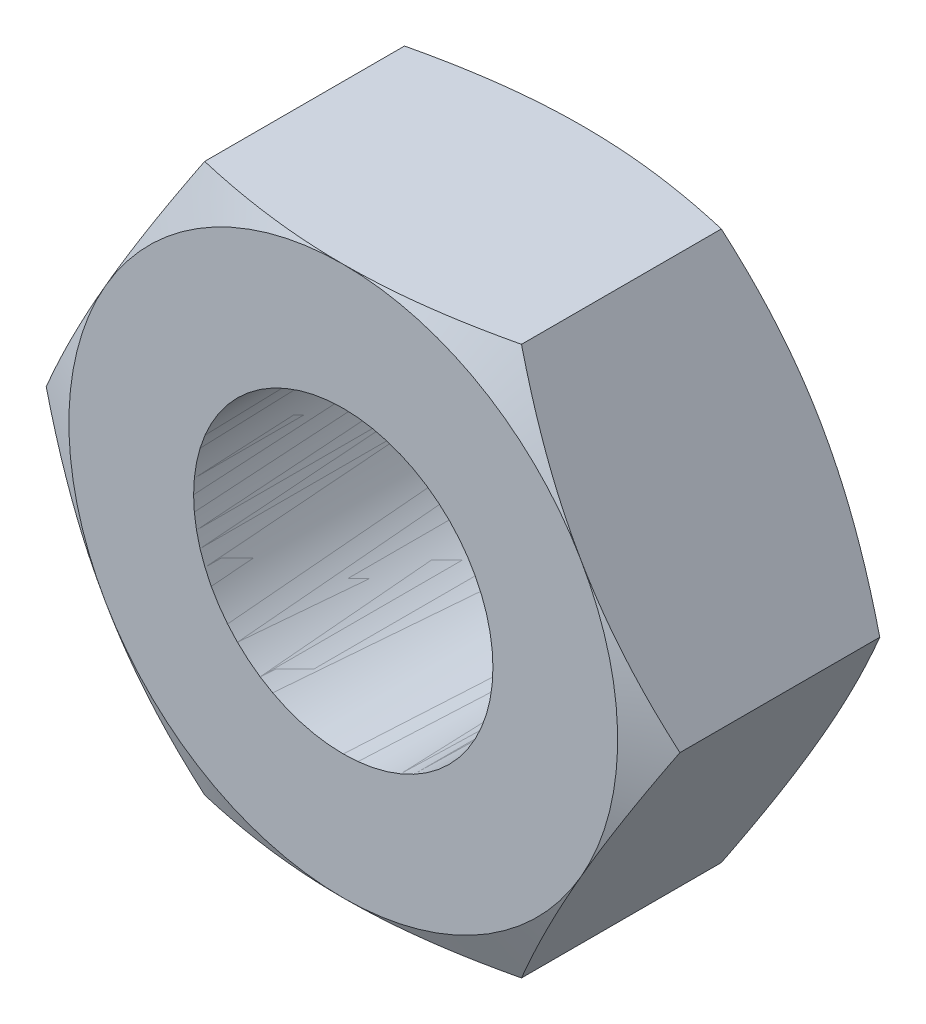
ISO-10303-21;
HEADER;
FILE_DESCRIPTION(('STEP AP214'),'2;1');
FILE_NAME('part.step','',(''),(''),'','','');
FILE_SCHEMA(('AUTOMOTIVE_DESIGN { 1 0 10303 214 1 1 1 1 }'));
ENDSEC;
DATA;
#1=APPLICATION_CONTEXT('core data for automotive mechanical design processes');
#2=APPLICATION_PROTOCOL_DEFINITION('international standard','automotive_design',2000,#1);
#3=PRODUCT_CONTEXT('',#1,'mechanical');
#4=PRODUCT('Part','Part','',(#3));
#5=PRODUCT_RELATED_PRODUCT_CATEGORY('part','',(#4));
#6=PRODUCT_DEFINITION_FORMATION('','',#4);
#7=PRODUCT_DEFINITION_CONTEXT('part definition',#1,'design');
#8=PRODUCT_DEFINITION('design','',#6,#7);
#9=PRODUCT_DEFINITION_SHAPE('','',#8);
#10=(LENGTH_UNIT() NAMED_UNIT(*) SI_UNIT(.MILLI.,.METRE.));
#11=(NAMED_UNIT(*) PLANE_ANGLE_UNIT() SI_UNIT($,.RADIAN.));
#12=(NAMED_UNIT(*) SI_UNIT($,.STERADIAN.) SOLID_ANGLE_UNIT());
#13=UNCERTAINTY_MEASURE_WITH_UNIT(LENGTH_MEASURE(1.E-05),#10,'distance_accuracy_value','');
#14=(GEOMETRIC_REPRESENTATION_CONTEXT(3) GLOBAL_UNCERTAINTY_ASSIGNED_CONTEXT((#13)) GLOBAL_UNIT_ASSIGNED_CONTEXT((#10,
#11,#12)) REPRESENTATION_CONTEXT('',''));
#15=CARTESIAN_POINT('',(0.,0.,0.));
#16=DIRECTION('',(0.,0.,1.));
#17=DIRECTION('',(1.,0.,0.));
#18=AXIS2_PLACEMENT_3D('',#15,#16,#17);
#19=CARTESIAN_POINT('',(1.587713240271,-2.75,0.));
#20=DIRECTION('',(0.866025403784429,-0.500000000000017,0.));
#21=DIRECTION('',(0.500000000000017,0.866025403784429,0.));
#22=AXIS2_PLACEMENT_3D('',#19,#20,#21);
#23=PLANE('',#22);
#24=CARTESIAN_POINT('',(3.17542648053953,1.05943048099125E-11,2.2016203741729));
#25=CARTESIAN_POINT('',(3.11028640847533,-0.112825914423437,2.23200076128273));
#26=CARTESIAN_POINT('',(3.04480636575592,-0.226240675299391,2.25972990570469));
#27=CARTESIAN_POINT('',(2.91346266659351,-0.453734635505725,2.30854135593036));
#28=CARTESIAN_POINT('',(2.84760103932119,-0.567810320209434,2.32964568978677));
#29=CARTESIAN_POINT('',(2.71530386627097,-0.796955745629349,2.36409667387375));
#30=CARTESIAN_POINT('',(2.6488679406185,-0.912026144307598,2.37743771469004));
#31=CARTESIAN_POINT('',(2.54888920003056,-1.08519440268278,2.39090948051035));
#32=CARTESIAN_POINT('',(2.51545111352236,-1.14311086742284,2.39431028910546));
#33=CARTESIAN_POINT('',(2.4485329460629,-1.25901653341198,2.39885876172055));
#34=CARTESIAN_POINT('',(2.41505286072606,-1.31700574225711,2.40000616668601));
#35=CARTESIAN_POINT('',(2.38156986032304,-1.37500000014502,2.40000000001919));
#36=B_SPLINE_CURVE_WITH_KNOTS('',3,(#24,#25,#26,#27,#28,#29,#30,#31,#32,#33,#34,#35),
.UNSPECIFIED.,.F.,.F.,(4,2,2,2,2,4),(0.,0.401386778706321,0.801424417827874,1.20175074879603,
1.40260488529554,1.60348211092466),.UNSPECIFIED.);
#37=CARTESIAN_POINT('',(3.17542648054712,1.71279261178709E-13,2.20162037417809));
#38=VERTEX_POINT('',#37);
#39=CARTESIAN_POINT('',(2.38156986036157,-1.37500000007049,2.40000000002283));
#40=VERTEX_POINT('',#39);
#41=EDGE_CURVE('P0_E357',#38,#40,#36,.T.);
#42=ORIENTED_EDGE('',*,*,#41,.T.);
#43=CARTESIAN_POINT('',(2.38156986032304,-1.37500000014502,2.40000000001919));
#44=CARTESIAN_POINT('',(2.34808685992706,-1.4329942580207,2.40000616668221));
#45=CARTESIAN_POINT('',(2.31460677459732,-1.49098346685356,2.39885876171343));
#46=CARTESIAN_POINT('',(2.2476886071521,-1.60688913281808,2.3943102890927));
#47=CARTESIAN_POINT('',(2.21425052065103,-1.66480559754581,2.39090948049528));
#48=CARTESIAN_POINT('',(2.11427178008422,-1.83797385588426,2.37743771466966));
#49=CARTESIAN_POINT('',(2.04783585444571,-1.95304425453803,2.36409667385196));
#50=CARTESIAN_POINT('',(1.91553868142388,-2.18218967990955,2.32964568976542));
#51=CARTESIAN_POINT('',(1.84967705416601,-2.29626536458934,2.30854135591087));
#52=CARTESIAN_POINT('',(1.71833335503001,-2.52375932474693,2.25972990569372));
#53=CARTESIAN_POINT('',(1.65285331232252,-2.63717408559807,2.23200076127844));
#54=CARTESIAN_POINT('',(1.58771324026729,-2.75000000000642,2.20162037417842));
#55=B_SPLINE_CURVE_WITH_KNOTS('',3,(#43,#44,#45,#46,#47,#48,#49,#50,#51,#52,#53,#54),
.UNSPECIFIED.,.F.,.F.,(4,2,2,2,2,4),(0.,0.200877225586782,0.401731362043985,0.802057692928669,
1.20209533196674,1.60348211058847),.UNSPECIFIED.);
#56=CARTESIAN_POINT('',(1.58771324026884,-2.75000000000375,2.20162037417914));
#57=VERTEX_POINT('',#56);
#58=EDGE_CURVE('P0_E157',#40,#57,#55,.T.);
#59=ORIENTED_EDGE('',*,*,#58,.T.);
#60=DIRECTION('',(0.,0.,-1.));
#61=VECTOR('',#60,1.);
#62=CARTESIAN_POINT('',(1.587713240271,-2.75,0.));
#63=LINE('',#62,#61);
#64=CARTESIAN_POINT('',(1.58771324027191,-2.75000000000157,0.19837962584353));
#65=VERTEX_POINT('',#64);
#66=EDGE_CURVE('P0_E138',#65,#57,#63,.F.);
#67=ORIENTED_EDGE('',*,*,#66,.F.);
#68=CARTESIAN_POINT('',(1.58771324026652,-2.750000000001,0.198379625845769));
#69=CARTESIAN_POINT('',(1.65285331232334,-2.63717408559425,0.167999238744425));
#70=CARTESIAN_POINT('',(1.71833335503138,-2.52375932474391,0.14027009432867));
#71=CARTESIAN_POINT('',(1.8496770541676,-2.29626536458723,0.0914586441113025));
#72=CARTESIAN_POINT('',(1.91553868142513,-2.18218967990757,0.0703543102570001));
#73=CARTESIAN_POINT('',(2.04783585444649,-1.95304425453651,0.0359033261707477));
#74=CARTESIAN_POINT('',(2.11427178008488,-1.83797385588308,0.0225622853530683));
#75=CARTESIAN_POINT('',(2.21425052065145,-1.6648055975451,0.00909051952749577));
#76=CARTESIAN_POINT('',(2.24768860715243,-1.60688913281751,0.0056897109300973));
#77=CARTESIAN_POINT('',(2.31460677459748,-1.49098346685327,0.00114123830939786));
#78=CARTESIAN_POINT('',(2.34808685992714,-1.43299425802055,-6.16665937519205E-06));
#79=CARTESIAN_POINT('',(2.38156986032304,-1.37500000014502,3.6409372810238E-12));
#80=B_SPLINE_CURVE_WITH_KNOTS('',3,(#68,#69,#70,#71,#72,#73,#74,#75,#76,#77,#78,#79),
.UNSPECIFIED.,.F.,.F.,(4,2,2,2,2,4),(0.,0.401386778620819,0.80142441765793,1.20175074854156,
1.40260488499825,1.60348211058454),.UNSPECIFIED.);
#81=CARTESIAN_POINT('',(2.38156986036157,-1.37500000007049,0.));
#82=VERTEX_POINT('',#81);
#83=EDGE_CURVE('P0_E21',#65,#82,#80,.T.);
#84=ORIENTED_EDGE('',*,*,#83,.T.);
#85=CARTESIAN_POINT('',(2.38156986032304,-1.37500000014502,3.64106855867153E-12));
#86=CARTESIAN_POINT('',(2.41505286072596,-1.31700574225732,-6.16666319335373E-06));
#87=CARTESIAN_POINT('',(2.44853294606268,-1.25901653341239,0.00114123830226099));
#88=CARTESIAN_POINT('',(2.51545111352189,-1.14311086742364,0.00568971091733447));
#89=CARTESIAN_POINT('',(2.54888920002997,-1.08519440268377,0.00909051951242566));
#90=CARTESIAN_POINT('',(2.64886794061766,-0.912026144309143,0.0225622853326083));
#91=CARTESIAN_POINT('',(2.71530386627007,-0.796955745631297,0.0359033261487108));
#92=CARTESIAN_POINT('',(2.8476010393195,-0.567810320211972,0.0703543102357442));
#93=CARTESIAN_POINT('',(2.91346266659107,-0.45373463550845,0.0914586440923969));
#94=CARTESIAN_POINT('',(3.04480636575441,-0.226240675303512,0.14027009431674));
#95=CARTESIAN_POINT('',(3.11028640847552,-0.112825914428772,0.167999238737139));
#96=CARTESIAN_POINT('',(3.17542648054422,2.9136169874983E-12,0.198379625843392));
#97=B_SPLINE_CURVE_WITH_KNOTS('',3,(#85,#86,#87,#88,#89,#90,#91,#92,#93,#94,#95,#96),
.UNSPECIFIED.,.F.,.F.,(4,2,2,2,2,4),(0.,0.200877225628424,0.40173136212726,0.802057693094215,
1.20209533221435,1.60348211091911),.UNSPECIFIED.);
#98=CARTESIAN_POINT('',(3.17542648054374,1.67338904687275E-12,0.198379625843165));
#99=VERTEX_POINT('',#98);
#100=EDGE_CURVE('P0_E155',#82,#99,#97,.T.);
#101=ORIENTED_EDGE('',*,*,#100,.T.);
#102=DIRECTION('',(0.,0.,1.));
#103=VECTOR('',#102,1.);
#104=CARTESIAN_POINT('',(3.175426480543,0.,0.));
#105=LINE('',#104,#103);
#106=EDGE_CURVE('P0_E171',#38,#99,#105,.F.);
#107=ORIENTED_EDGE('',*,*,#106,.F.);
#108=EDGE_LOOP('',(#42,#59,#67,#84,#101,#107));
#109=FACE_BOUND('',#108,.T.);
#110=ADVANCED_FACE('P0_F17',(#109),#23,.T.);
#111=CARTESIAN_POINT('',(3.175426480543,0.,0.));
#112=DIRECTION('',(0.866025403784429,0.500000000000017,0.));
#113=DIRECTION('',(-0.500000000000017,0.866025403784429,0.));
#114=AXIS2_PLACEMENT_3D('',#111,#112,#113);
#115=PLANE('',#114);
#116=CARTESIAN_POINT('',(1.58771324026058,2.75000000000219,2.2016203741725));
#117=CARTESIAN_POINT('',(1.65285331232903,2.63717408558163,2.23200076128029));
#118=CARTESIAN_POINT('',(1.71833335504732,2.52375932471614,2.25972990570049));
#119=CARTESIAN_POINT('',(1.84967705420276,2.29626536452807,2.3085413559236));
#120=CARTESIAN_POINT('',(1.91553868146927,2.18218967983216,2.32964568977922));
#121=CARTESIAN_POINT('',(2.04783585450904,1.9530442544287,2.36409667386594));
#122=CARTESIAN_POINT('',(2.11427178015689,1.83797385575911,2.37743771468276));
#123=CARTESIAN_POINT('',(2.21425052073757,1.66480559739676,2.39090948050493));
#124=CARTESIAN_POINT('',(2.24768860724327,1.60688913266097,2.39431028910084));
#125=CARTESIAN_POINT('',(2.31460677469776,1.49098346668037,2.39885876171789));
#126=CARTESIAN_POINT('',(2.34808686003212,1.43299425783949,2.4000061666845));
#127=CARTESIAN_POINT('',(2.38156986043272,1.37499999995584,2.400000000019));
#128=B_SPLINE_CURVE_WITH_KNOTS('',3,(#116,#117,#118,#119,#120,#121,#122,#123,#124,#125,#126,
#127),.UNSPECIFIED.,.F.,.F.,(4,2,2,2,2,4),(0.,0.401386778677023,0.801424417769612,
1.20175074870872,1.40260488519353,1.60348211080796),.UNSPECIFIED.);
#129=CARTESIAN_POINT('',(1.58771324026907,2.75000000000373,2.20162037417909));
#130=VERTEX_POINT('',#129);
#131=CARTESIAN_POINT('',(2.38156986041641,1.3749999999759,2.40000000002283));
#132=VERTEX_POINT('',#131);
#133=EDGE_CURVE('P0_E321',#130,#132,#128,.T.);
#134=ORIENTED_EDGE('',*,*,#133,.T.);
#135=CARTESIAN_POINT('',(2.38156986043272,1.37499999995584,2.400000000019));
#136=CARTESIAN_POINT('',(2.41505286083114,1.31700574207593,2.40000616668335));
#137=CARTESIAN_POINT('',(2.44853294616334,1.25901653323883,2.39885876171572));
#138=CARTESIAN_POINT('',(2.51545111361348,1.14311086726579,2.39431028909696));
#139=CARTESIAN_POINT('',(2.54888920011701,1.08519440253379,2.39090948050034));
#140=CARTESIAN_POINT('',(2.64886794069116,0.91202614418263,2.37743771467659));
#141=CARTESIAN_POINT('',(2.71530386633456,0.796955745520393,2.36409667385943));
#142=CARTESIAN_POINT('',(2.84760103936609,0.56781032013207,2.32964568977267));
#143=CARTESIAN_POINT('',(2.91346266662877,0.453734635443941,2.30854135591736));
#144=CARTESIAN_POINT('',(3.04480636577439,0.226240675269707,2.25972990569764));
#145=CARTESIAN_POINT('',(3.11028640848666,0.112825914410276,2.23200076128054));
#146=CARTESIAN_POINT('',(3.17542648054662,-6.27665703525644E-12,2.20162037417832));
#147=B_SPLINE_CURVE_WITH_KNOTS('',3,(#135,#136,#137,#138,#139,#140,#141,#142,#143,#144,#145,
#146),.UNSPECIFIED.,.F.,.F.,(4,2,2,2,2,4),(0.,0.200877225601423,0.401731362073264,
0.802057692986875,1.2020953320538,1.60348211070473),.UNSPECIFIED.);
#148=EDGE_CURVE('P0_E336',#132,#38,#147,.T.);
#149=ORIENTED_EDGE('',*,*,#148,.T.);
#150=ORIENTED_EDGE('',*,*,#106,.T.);
#151=CARTESIAN_POINT('',(3.17542648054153,-4.24707716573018E-12,0.198379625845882));
#152=CARTESIAN_POINT('',(3.11028640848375,0.112825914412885,0.167999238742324));
#153=CARTESIAN_POINT('',(3.04480636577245,0.226240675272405,0.140270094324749));
#154=CARTESIAN_POINT('',(2.91346266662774,0.453734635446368,0.0914586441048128));
#155=CARTESIAN_POINT('',(2.84760103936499,0.56781032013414,0.0703543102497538));
#156=CARTESIAN_POINT('',(2.71530386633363,0.796955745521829,0.0359033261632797));
#157=CARTESIAN_POINT('',(2.64886794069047,0.91202614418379,0.022562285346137));
#158=CARTESIAN_POINT('',(2.5488892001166,1.08519440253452,0.00909051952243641));
#159=CARTESIAN_POINT('',(2.51545111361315,1.14311086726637,0.00568971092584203));
#160=CARTESIAN_POINT('',(2.44853294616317,1.25901653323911,0.00114123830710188));
#161=CARTESIAN_POINT('',(2.41505286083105,1.31700574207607,-6.16666051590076E-06));
#162=CARTESIAN_POINT('',(2.38156986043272,1.37499999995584,3.8260579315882E-12));
#163=B_SPLINE_CURVE_WITH_KNOTS('',3,(#151,#152,#153,#154,#155,#156,#157,#158,#159,#160,#161,
#162),.UNSPECIFIED.,.F.,.F.,(4,2,2,2,2,4),(0.,0.401386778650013,0.801424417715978,
1.20175074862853,1.40260488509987,1.6034821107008),.UNSPECIFIED.);
#164=CARTESIAN_POINT('',(2.38156986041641,1.3749999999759,0.));
#165=VERTEX_POINT('',#164);
#166=EDGE_CURVE('P0_E174',#99,#165,#163,.T.);
#167=ORIENTED_EDGE('',*,*,#166,.T.);
#168=CARTESIAN_POINT('',(2.38156986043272,1.37499999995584,3.82606591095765E-12));
#169=CARTESIAN_POINT('',(2.34808686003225,1.43299425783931,-6.16666168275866E-06));
#170=CARTESIAN_POINT('',(2.31460677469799,1.49098346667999,0.00114123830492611));
#171=CARTESIAN_POINT('',(2.24768860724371,1.6068891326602,0.00568971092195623));
#172=CARTESIAN_POINT('',(2.2142505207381,1.66480559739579,0.00909051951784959));
#173=CARTESIAN_POINT('',(2.11427178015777,1.83797385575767,0.0225622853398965));
#174=CARTESIAN_POINT('',(2.04783585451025,1.95304425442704,0.0359033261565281));
#175=CARTESIAN_POINT('',(1.91553868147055,2.18218967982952,0.0703543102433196));
#176=CARTESIAN_POINT('',(1.8496770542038,2.29626536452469,0.0914586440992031));
#177=CARTESIAN_POINT('',(1.71833335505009,2.52375932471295,0.140270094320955));
#178=CARTESIAN_POINT('',(1.65285331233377,2.63717408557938,0.167999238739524));
#179=CARTESIAN_POINT('',(1.58771324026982,2.75000000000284,0.198379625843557));
#180=B_SPLINE_CURVE_WITH_KNOTS('',3,(#168,#169,#170,#171,#172,#173,#174,#175,#176,#177,#178,
#179),.UNSPECIFIED.,.F.,.F.,(4,2,2,2,2,4),(0.,0.200877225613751,0.401731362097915,
0.802057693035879,1.20209533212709,1.6034821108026),.UNSPECIFIED.);
#181=CARTESIAN_POINT('',(1.58771324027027,2.75000000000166,0.198379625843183));
#182=VERTEX_POINT('',#181);
#183=EDGE_CURVE('P0_E315',#165,#182,#180,.T.);
#184=ORIENTED_EDGE('',*,*,#183,.T.);
#185=DIRECTION('',(0.,0.,1.));
#186=VECTOR('',#185,1.);
#187=CARTESIAN_POINT('',(1.587713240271,2.75,0.));
#188=LINE('',#187,#186);
#189=EDGE_CURVE('P0_E169',#130,#182,#188,.F.);
#190=ORIENTED_EDGE('',*,*,#189,.F.);
#191=EDGE_LOOP('',(#134,#149,#150,#167,#184,#190));
#192=FACE_BOUND('',#191,.T.);
#193=ADVANCED_FACE('P0_F330',(#192),#115,.T.);
#194=CARTESIAN_POINT('',(-1.587713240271,-2.75,0.));
#195=DIRECTION('',(0.,-1.,0.));
#196=DIRECTION('',(0.,0.,-1.));
#197=AXIS2_PLACEMENT_3D('',#194,#195,#196);
#198=PLANE('',#197);
#199=CARTESIAN_POINT('',(1.58771324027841,-2.74999999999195,2.20162037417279));
#200=CARTESIAN_POINT('',(1.45743309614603,-2.74999999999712,2.23200076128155));
#201=CARTESIAN_POINT('',(1.32647301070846,-2.74999999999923,2.2597299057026));
#202=CARTESIAN_POINT('',(1.06378561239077,-2.75000000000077,2.30854135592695));
#203=CARTESIAN_POINT('',(0.932062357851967,-2.7500000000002,2.32964568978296));
#204=CARTESIAN_POINT('',(0.667468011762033,-2.7499999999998,2.36409667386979));
#205=CARTESIAN_POINT('',(0.534596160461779,-2.74999999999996,2.37743771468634));
#206=CARTESIAN_POINT('',(0.334638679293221,-2.75000000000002,2.39090948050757));
#207=CARTESIAN_POINT('',(0.267762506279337,-2.75000000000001,2.39431028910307));
#208=CARTESIAN_POINT('',(0.133926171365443,-2.74999999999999,2.39885876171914));
#209=CARTESIAN_POINT('',(0.066966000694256,-2.74999999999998,2.40000616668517));
#210=CARTESIAN_POINT('',(-1.09340457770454E-10,-2.75,2.40000000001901));
#211=B_SPLINE_CURVE_WITH_KNOTS('',3,(#199,#200,#201,#202,#203,#204,#205,#206,#207,#208,#209,
#210),.UNSPECIFIED.,.F.,.F.,(4,2,2,2,2,4),(0.,0.401386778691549,0.801424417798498,
1.20175074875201,1.40260488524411,1.60348211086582),.UNSPECIFIED.);
#212=CARTESIAN_POINT('',(-5.46700157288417E-11,-2.74999999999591,2.40000000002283));
#213=VERTEX_POINT('',#212);
#214=EDGE_CURVE('P0_E159',#57,#213,#211,.T.);
#215=ORIENTED_EDGE('',*,*,#214,.T.);
#216=CARTESIAN_POINT('',(-1.0934057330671E-10,-2.75,2.40000000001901));
#217=CARTESIAN_POINT('',(-0.0669660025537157,-2.75,2.4000061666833));
#218=CARTESIAN_POINT('',(-0.133926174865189,-2.75,2.39885876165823));
#219=CARTESIAN_POINT('',(-0.267762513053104,-2.75,2.39431028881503));
#220=CARTESIAN_POINT('',(-0.334638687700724,-2.75,2.39090948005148));
#221=CARTESIAN_POINT('',(-0.534596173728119,-2.75,2.37743771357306));
#222=CARTESIAN_POINT('',(-0.667468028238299,-2.75,2.3640966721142));
#223=CARTESIAN_POINT('',(-0.93206238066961,-2.75,2.32964568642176));
#224=CARTESIAN_POINT('',(-1.06378563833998,-2.75,2.30854135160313));
#225=CARTESIAN_POINT('',(-1.3264730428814,-2.75,2.2597298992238));
#226=CARTESIAN_POINT('',(-1.45743313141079,-2.75,2.23200075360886));
#227=CARTESIAN_POINT('',(-1.58771327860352,-2.75,2.20162036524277));
#228=B_SPLINE_CURVE_WITH_KNOTS('',3,(#216,#217,#218,#219,#220,#221,#222,#223,#224,#225,#226,
#227),.UNSPECIFIED.,.F.,.F.,(4,2,2,2,2,4),(0.,0.200877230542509,0.401731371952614,
0.802057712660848,1.20209536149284,1.6034821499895),.UNSPECIFIED.);
#229=CARTESIAN_POINT('',(-1.58771325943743,-2.7500000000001,2.20162036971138));
#230=VERTEX_POINT('',#229);
#231=EDGE_CURVE('P0_E165',#213,#230,#228,.T.);
#232=ORIENTED_EDGE('',*,*,#231,.T.);
#233=DIRECTION('',(0.,0.,1.));
#234=VECTOR('',#233,1.);
#235=CARTESIAN_POINT('',(-1.58771324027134,-2.7500000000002,0.));
#236=LINE('',#235,#234);
#237=CARTESIAN_POINT('',(-1.58771324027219,-2.75000000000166,0.198379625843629));
#238=VERTEX_POINT('',#237);
#239=EDGE_CURVE('P0_E393',#238,#230,#236,.T.);
#240=ORIENTED_EDGE('',*,*,#239,.F.);
#241=CARTESIAN_POINT('',(-1.58771324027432,-2.74999999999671,0.19837962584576));
#242=CARTESIAN_POINT('',(-1.45743309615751,-2.74999999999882,0.167999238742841));
#243=CARTESIAN_POINT('',(-1.32647301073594,-2.74999999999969,0.140270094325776));
#244=CARTESIAN_POINT('',(-1.06378561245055,-2.75000000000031,0.09145864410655));
#245=CARTESIAN_POINT('',(-0.932062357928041,-2.75000000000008,0.0703543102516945));
#246=CARTESIAN_POINT('',(-0.667468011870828,-2.74999999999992,0.0359033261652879));
#247=CARTESIAN_POINT('',(-0.534596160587,-2.74999999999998,0.022562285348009));
#248=CARTESIAN_POINT('',(-0.334638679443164,-2.75000000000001,0.00909051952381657));
#249=CARTESIAN_POINT('',(-0.267762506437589,-2.75,0.00568971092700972));
#250=CARTESIAN_POINT('',(-0.133926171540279,-2.75,0.00114123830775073));
#251=CARTESIAN_POINT('',(-0.0669660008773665,-2.74999999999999,-6.16666017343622E-06));
#252=CARTESIAN_POINT('',(-8.20055384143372E-11,-2.75,3.81689993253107E-12));
#253=B_SPLINE_CURVE_WITH_KNOTS('',3,(#241,#242,#243,#244,#245,#246,#247,#248,#249,#250,#251,
#252),.UNSPECIFIED.,.F.,.F.,(4,2,2,2,2,4),(0.,0.401386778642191,0.801424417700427,
1.20175074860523,1.40260488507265,1.60348211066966),.UNSPECIFIED.);
#254=CARTESIAN_POINT('',(-5.46706050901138E-11,-2.74999999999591,0.));
#255=VERTEX_POINT('',#254);
#256=EDGE_CURVE('P0_E142',#238,#255,#253,.T.);
#257=ORIENTED_EDGE('',*,*,#256,.T.);
#258=CARTESIAN_POINT('',(-8.20059443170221E-11,-2.75,3.81691345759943E-12));
#259=CARTESIAN_POINT('',(0.0669660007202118,-2.75,-6.16666204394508E-06));
#260=CARTESIAN_POINT('',(0.133926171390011,-2.75,0.00114123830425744));
#261=CARTESIAN_POINT('',(0.267762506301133,-2.75,0.00568971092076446));
#262=CARTESIAN_POINT('',(0.334638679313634,-2.75,0.00909051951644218));
#263=CARTESIAN_POINT('',(0.534596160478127,-2.75,0.0225622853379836));
#264=CARTESIAN_POINT('',(0.667468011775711,-2.75,0.0359033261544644));
#265=CARTESIAN_POINT('',(0.93206235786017,-2.75,0.0703543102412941));
#266=CARTESIAN_POINT('',(1.06378561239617,-2.75,0.0914586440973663));
#267=CARTESIAN_POINT('',(1.32647301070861,-2.75,0.140270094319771));
#268=CARTESIAN_POINT('',(1.45743309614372,-2.75,0.167999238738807));
#269=CARTESIAN_POINT('',(1.58771324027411,-2.75,0.198379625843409));
#270=B_SPLINE_CURVE_WITH_KNOTS('',3,(#258,#259,#260,#261,#262,#263,#264,#265,#266,#267,#268,
#269),.UNSPECIFIED.,.F.,.F.,(4,2,2,2,2,4),(0.,0.20087722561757,0.401731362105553,
0.802057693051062,1.2020953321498,1.60348211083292),.UNSPECIFIED.);
#271=EDGE_CURVE('P0_E134',#255,#65,#270,.T.);
#272=ORIENTED_EDGE('',*,*,#271,.T.);
#273=ORIENTED_EDGE('',*,*,#66,.T.);
#274=EDGE_LOOP('',(#215,#232,#240,#257,#272,#273));
#275=FACE_BOUND('',#274,.T.);
#276=ADVANCED_FACE('P0_F136',(#275),#198,.T.);
#277=CARTESIAN_POINT('',(1.587713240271,2.75,0.));
#278=DIRECTION('',(0.,1.,0.));
#279=DIRECTION('',(0.,0.,1.));
#280=AXIS2_PLACEMENT_3D('',#277,#278,#279);
#281=PLANE('',#280);
#282=CARTESIAN_POINT('',(1.09340436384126E-10,2.75,2.40000000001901));
#283=CARTESIAN_POINT('',(-0.0669659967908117,2.75,2.40000616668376));
#284=CARTESIAN_POINT('',(-0.133926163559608,2.75,2.39885876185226));
#285=CARTESIAN_POINT('',(-0.267762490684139,2.75,2.39431028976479));
#286=CARTESIAN_POINT('',(-0.334638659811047,2.75,2.39090948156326));
#287=CARTESIAN_POINT('',(-0.534596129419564,2.75,2.37743771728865));
#288=CARTESIAN_POINT('',(-0.667467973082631,2.75,2.36409667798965));
#289=CARTESIAN_POINT('',(-0.932062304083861,2.75,2.32964569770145));
#290=CARTESIAN_POINT('',(-1.06378555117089,2.75,2.30854136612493));
#291=CARTESIAN_POINT('',(-1.32647293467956,2.75,2.25972992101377));
#292=CARTESIAN_POINT('',(-1.45743301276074,2.75,2.23200077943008));
#293=CARTESIAN_POINT('',(-1.5877131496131,2.75,2.20162039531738));
#294=B_SPLINE_CURVE_WITH_KNOTS('',3,(#282,#283,#284,#285,#286,#287,#288,#289,#290,#291,#292,
#293),.UNSPECIFIED.,.F.,.F.,(4,2,2,2,2,4),(0.,0.200877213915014,0.401731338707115,
0.802057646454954,1.20209526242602,1.60348201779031),.UNSPECIFIED.);
#295=CARTESIAN_POINT('',(5.46698788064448E-11,2.74999999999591,2.40000000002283));
#296=VERTEX_POINT('',#295);
#297=CARTESIAN_POINT('',(-1.58771318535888,2.75000001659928,2.20162038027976));
#298=VERTEX_POINT('',#297);
#299=EDGE_CURVE('P0_E255',#296,#298,#294,.T.);
#300=ORIENTED_EDGE('',*,*,#299,.F.);
#301=CARTESIAN_POINT('',(1.58771324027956,2.75,2.20162037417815));
#302=CARTESIAN_POINT('',(1.45743309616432,2.75,2.23200076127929));
#303=CARTESIAN_POINT('',(1.32647301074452,2.75,2.2597299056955));
#304=CARTESIAN_POINT('',(1.0637856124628,2.75,2.30854135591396));
#305=CARTESIAN_POINT('',(0.932062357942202,2.75,2.32964568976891));
#306=CARTESIAN_POINT('',(0.667468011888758,2.75,2.36409667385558));
#307=CARTESIAN_POINT('',(0.534596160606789,2.75,2.37743771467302));
#308=CARTESIAN_POINT('',(0.334638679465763,2.75,2.39090948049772));
#309=CARTESIAN_POINT('',(0.267762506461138,2.75,2.39431028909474));
#310=CARTESIAN_POINT('',(0.133926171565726,2.75,2.39885876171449));
#311=CARTESIAN_POINT('',(0.0669660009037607,2.75,2.4000061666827));
#312=CARTESIAN_POINT('',(1.09340433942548E-10,2.75,2.40000000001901));
#313=B_SPLINE_CURVE_WITH_KNOTS('',3,(#301,#302,#303,#304,#305,#306,#307,#308,#309,#310,#311,
#312),.UNSPECIFIED.,.F.,.F.,(4,2,2,2,2,4),(0.,0.401386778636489,0.801424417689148,
1.20175074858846,1.40260488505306,1.60348211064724),.UNSPECIFIED.);
#314=EDGE_CURVE('P0_E263',#130,#296,#313,.T.);
#315=ORIENTED_EDGE('',*,*,#314,.F.);
#316=ORIENTED_EDGE('',*,*,#189,.T.);
#317=CARTESIAN_POINT('',(1.58771324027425,2.74999999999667,0.198379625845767));
#318=CARTESIAN_POINT('',(1.45743309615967,2.74999999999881,0.167999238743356));
#319=CARTESIAN_POINT('',(1.32647301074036,2.74999999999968,0.140270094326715));
#320=CARTESIAN_POINT('',(1.0637856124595,2.75000000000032,0.0914586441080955));
#321=CARTESIAN_POINT('',(0.932062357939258,2.75000000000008,0.0703543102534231));
#322=CARTESIAN_POINT('',(0.667468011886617,2.74999999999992,0.0359033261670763));
#323=CARTESIAN_POINT('',(0.534596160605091,2.74999999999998,0.0225622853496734));
#324=CARTESIAN_POINT('',(0.334638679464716,2.75000000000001,0.00909051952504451));
#325=CARTESIAN_POINT('',(0.267762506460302,2.75,0.00568971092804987));
#326=CARTESIAN_POINT('',(0.133926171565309,2.75,0.00114123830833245));
#327=CARTESIAN_POINT('',(0.0669660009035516,2.74999999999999,-6.16665986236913E-06));
#328=CARTESIAN_POINT('',(1.09341077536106E-10,2.75,3.81688347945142E-12));
#329=B_SPLINE_CURVE_WITH_KNOTS('',3,(#317,#318,#319,#320,#321,#322,#323,#324,#325,#326,#327,
#328),.UNSPECIFIED.,.F.,.F.,(4,2,2,2,2,4),(0.,0.401386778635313,0.80142441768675,
1.20175074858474,1.40260488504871,1.60348211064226),.UNSPECIFIED.);
#330=CARTESIAN_POINT('',(5.46704367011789E-11,2.74999999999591,0.));
#331=VERTEX_POINT('',#330);
#332=EDGE_CURVE('P0_E293',#182,#331,#329,.T.);
#333=ORIENTED_EDGE('',*,*,#332,.T.);
#334=CARTESIAN_POINT('',(1.09340994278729E-10,2.75,3.81691899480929E-12));
#335=CARTESIAN_POINT('',(-0.0669660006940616,2.75,-6.16666235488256E-06));
#336=CARTESIAN_POINT('',(-0.13392617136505,2.75,0.00114123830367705));
#337=CARTESIAN_POINT('',(-0.267762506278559,2.75,0.00568971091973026));
#338=CARTESIAN_POINT('',(-0.334638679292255,2.75,0.00909051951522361));
#339=CARTESIAN_POINT('',(-0.53459616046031,2.75,0.0225622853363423));
#340=CARTESIAN_POINT('',(-0.667468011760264,2.75,0.035903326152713));
#341=CARTESIAN_POINT('',(-0.932062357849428,2.75,0.0703543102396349));
#342=CARTESIAN_POINT('',(-1.06378561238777,2.75,0.0914586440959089));
#343=CARTESIAN_POINT('',(-1.32647301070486,2.75,0.14027009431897));
#344=CARTESIAN_POINT('',(-1.4574330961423,2.75,0.167999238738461));
#345=CARTESIAN_POINT('',(-1.58771324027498,2.75,0.198379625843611));
#346=B_SPLINE_CURVE_WITH_KNOTS('',3,(#334,#335,#336,#337,#338,#339,#340,#341,#342,#343,#344,
#345),.UNSPECIFIED.,.F.,.F.,(4,2,2,2,2,4),(0.,0.200877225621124,0.401731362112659,
0.80205769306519,1.20209533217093,1.60348211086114),.UNSPECIFIED.);
#347=CARTESIAN_POINT('',(-1.5877132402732,2.75,0.198379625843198));
#348=VERTEX_POINT('',#347);
#349=EDGE_CURVE('P0_E286',#331,#348,#346,.T.);
#350=ORIENTED_EDGE('',*,*,#349,.T.);
#351=DIRECTION('',(0.,0.,1.));
#352=VECTOR('',#351,1.);
#353=CARTESIAN_POINT('',(-1.587713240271,2.75,0.));
#354=LINE('',#353,#352);
#355=EDGE_CURVE('P0_E458',#298,#348,#354,.F.);
#356=ORIENTED_EDGE('',*,*,#355,.F.);
#357=EDGE_LOOP('',(#300,#315,#316,#333,#350,#356));
#358=FACE_BOUND('',#357,.T.);
#359=ADVANCED_FACE('P0_F272',(#358),#281,.T.);
#360=CARTESIAN_POINT('',(-3.175426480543,0.,0.));
#361=DIRECTION('',(-0.866025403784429,-0.500000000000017,0.));
#362=DIRECTION('',(0.500000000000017,-0.866025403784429,0.));
#363=AXIS2_PLACEMENT_3D('',#360,#361,#362);
#364=PLANE('',#363);
#365=CARTESIAN_POINT('',(-2.38156986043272,-1.37499999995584,2.400000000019));
#366=CARTESIAN_POINT('',(-2.34808686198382,-1.4329942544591,2.40000616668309));
#367=CARTESIAN_POINT('',(-2.31460677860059,-1.49098345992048,2.398858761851));
#368=CARTESIAN_POINT('',(-2.24768861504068,-1.60688911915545,2.39431028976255));
#369=CARTESIAN_POINT('',(-2.21425053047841,-1.66480558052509,2.3909094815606));
#370=CARTESIAN_POINT('',(-2.11427179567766,-1.83797382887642,2.37743771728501));
#371=CARTESIAN_POINT('',(-2.04783587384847,-1.95304422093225,2.36409667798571));
#372=CARTESIAN_POINT('',(-1.91553870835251,-2.1821896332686,2.32964569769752));
#373=CARTESIAN_POINT('',(-1.8496770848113,-2.29626531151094,2.30854136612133));
#374=CARTESIAN_POINT('',(-1.71833339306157,-2.52375925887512,2.25972992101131));
#375=CARTESIAN_POINT('',(-1.65285335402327,-2.63717401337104,2.23200077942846));
#376=CARTESIAN_POINT('',(-1.58771328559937,-2.74999992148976,2.20162039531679));
#377=B_SPLINE_CURVE_WITH_KNOTS('',3,(#365,#366,#367,#368,#369,#370,#371,#372,#373,#374,#375,
#376),.UNSPECIFIED.,.F.,.F.,(4,2,2,2,2,4),(0.,0.200877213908,0.401731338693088,
0.802057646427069,1.20209526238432,1.60348201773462),.UNSPECIFIED.);
#378=CARTESIAN_POINT('',(-2.38156986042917,-1.37499999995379,2.40000000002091));
#379=VERTEX_POINT('',#378);
#380=EDGE_CURVE('P0_E401',#379,#230,#377,.T.);
#381=ORIENTED_EDGE('',*,*,#380,.F.);
#382=CARTESIAN_POINT('',(-3.1754264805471,7.10854052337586E-12,2.20162037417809));
#383=CARTESIAN_POINT('',(-3.1102864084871,-0.112825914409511,2.23200076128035));
#384=CARTESIAN_POINT('',(-3.04480636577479,-0.22624067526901,2.25972990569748));
#385=CARTESIAN_POINT('',(-2.9134626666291,-0.453734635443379,2.30854135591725));
#386=CARTESIAN_POINT('',(-2.84760103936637,-0.567810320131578,2.32964568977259));
#387=CARTESIAN_POINT('',(-2.71530386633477,-0.796955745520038,2.36409667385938));
#388=CARTESIAN_POINT('',(-2.64886794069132,-0.912026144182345,2.37743771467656));
#389=CARTESIAN_POINT('',(-2.54888920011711,-1.08519440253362,2.39090948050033));
#390=CARTESIAN_POINT('',(-2.51545111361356,-1.14311086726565,2.39431028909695));
#391=CARTESIAN_POINT('',(-2.44853294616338,-1.25901653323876,2.39885876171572));
#392=CARTESIAN_POINT('',(-2.41505286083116,-1.3170057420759,2.40000616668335));
#393=CARTESIAN_POINT('',(-2.38156986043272,-1.37499999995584,2.400000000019));
#394=B_SPLINE_CURVE_WITH_KNOTS('',3,(#382,#383,#384,#385,#386,#387,#388,#389,#390,#391,#392,
#393),.UNSPECIFIED.,.F.,.F.,(4,2,2,2,2,4),(0.,0.401386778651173,0.801424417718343,
1.2017507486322,1.40260488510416,1.60348211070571),.UNSPECIFIED.);
#395=CARTESIAN_POINT('',(-3.17542648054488,3.45474047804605E-12,2.20162037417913));
#396=VERTEX_POINT('',#395);
#397=EDGE_CURVE('P0_E262',#396,#379,#394,.T.);
#398=ORIENTED_EDGE('',*,*,#397,.F.);
#399=DIRECTION('',(0.,0.,1.));
#400=VECTOR('',#399,1.);
#401=CARTESIAN_POINT('',(-3.17542648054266,-1.99059518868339E-13,0.));
#402=LINE('',#401,#400);
#403=CARTESIAN_POINT('',(-3.17542648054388,1.7280133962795E-12,0.198379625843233));
#404=VERTEX_POINT('',#403);
#405=EDGE_CURVE('P0_E461',#404,#396,#402,.T.);
#406=ORIENTED_EDGE('',*,*,#405,.F.);
#407=CARTESIAN_POINT('',(-3.17542648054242,4.69881070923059E-12,0.198379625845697));
#408=CARTESIAN_POINT('',(-3.11028640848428,-0.112825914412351,0.167999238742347));
#409=CARTESIAN_POINT('',(-3.04480636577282,-0.226240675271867,0.140270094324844));
#410=CARTESIAN_POINT('',(-2.91346266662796,-0.453734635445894,0.091458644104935));
#411=CARTESIAN_POINT('',(-2.84760103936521,-0.567810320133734,0.0703543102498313));
#412=CARTESIAN_POINT('',(-2.71530386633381,-0.796955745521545,0.035903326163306));
#413=CARTESIAN_POINT('',(-2.6488679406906,-0.912026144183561,0.0225622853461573));
#414=CARTESIAN_POINT('',(-2.54888920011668,-1.08519440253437,0.00909051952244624));
#415=CARTESIAN_POINT('',(-2.51545111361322,-1.14311086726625,0.00568971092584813));
#416=CARTESIAN_POINT('',(-2.4485329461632,-1.25901653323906,0.00114123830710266));
#417=CARTESIAN_POINT('',(-2.41505286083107,-1.31700574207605,-6.16666051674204E-06));
#418=CARTESIAN_POINT('',(-2.38156986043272,-1.37499999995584,3.8259960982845E-12));
#419=B_SPLINE_CURVE_WITH_KNOTS('',3,(#407,#408,#409,#410,#411,#412,#413,#414,#415,#416,#417,
#418),.UNSPECIFIED.,.F.,.F.,(4,2,2,2,2,4),(0.,0.401386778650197,0.801424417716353,
1.20175074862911,1.40260488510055,1.60348211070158),.UNSPECIFIED.);
#420=CARTESIAN_POINT('',(-2.38156986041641,-1.3749999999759,0.));
#421=VERTEX_POINT('',#420);
#422=EDGE_CURVE('P0_E292',#404,#421,#419,.T.);
#423=ORIENTED_EDGE('',*,*,#422,.T.);
#424=CARTESIAN_POINT('',(-2.38156986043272,-1.37499999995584,3.82613744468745E-12));
#425=CARTESIAN_POINT('',(-2.34808686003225,-1.43299425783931,-6.16666168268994E-06));
#426=CARTESIAN_POINT('',(-2.31460677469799,-1.49098346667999,0.0011412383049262));
#427=CARTESIAN_POINT('',(-2.24768860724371,-1.6068891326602,0.00568971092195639));
#428=CARTESIAN_POINT('',(-2.2142505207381,-1.66480559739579,0.0090905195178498));
#429=CARTESIAN_POINT('',(-2.11427178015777,-1.83797385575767,0.0225622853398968));
#430=CARTESIAN_POINT('',(-2.04783585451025,-1.95304425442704,0.0359033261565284));
#431=CARTESIAN_POINT('',(-1.91553868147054,-2.18218967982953,0.0703543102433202));
#432=CARTESIAN_POINT('',(-1.8496770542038,-2.29626536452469,0.0914586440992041));
#433=CARTESIAN_POINT('',(-1.71833335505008,-2.52375932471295,0.140270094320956));
#434=CARTESIAN_POINT('',(-1.65285331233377,-2.63717408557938,0.167999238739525));
#435=CARTESIAN_POINT('',(-1.58771324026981,-2.75000000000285,0.198379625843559));
#436=B_SPLINE_CURVE_WITH_KNOTS('',3,(#424,#425,#426,#427,#428,#429,#430,#431,#432,#433,#434,
#435),.UNSPECIFIED.,.F.,.F.,(4,2,2,2,2,4),(0.,0.200877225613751,0.401731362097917,
0.802057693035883,1.2020953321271,1.60348211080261),.UNSPECIFIED.);
#437=EDGE_CURVE('P0_E404',#421,#238,#436,.T.);
#438=ORIENTED_EDGE('',*,*,#437,.T.);
#439=ORIENTED_EDGE('',*,*,#239,.T.);
#440=EDGE_LOOP('',(#381,#398,#406,#423,#438,#439));
#441=FACE_BOUND('',#440,.T.);
#442=ADVANCED_FACE('P0_F276',(#441),#364,.T.);
#443=CARTESIAN_POINT('',(0.,0.,2.20043009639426));
#444=DIRECTION('',(0.,0.,-1.));
#445=DIRECTION('',(-1.,0.,0.));
#446=AXIS2_PLACEMENT_3D('',#443,#444,#445);
#447=CONICAL_SURFACE('',#446,3.17797903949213,1.13446401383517);
#448=ORIENTED_EDGE('',*,*,#380,.T.);
#449=ORIENTED_EDGE('',*,*,#231,.F.);
#450=CARTESIAN_POINT('',(0.,0.,2.40000000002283));
#451=DIRECTION('',(0.,0.,-1.));
#452=DIRECTION('',(-1.,0.,0.));
#453=AXIS2_PLACEMENT_3D('',#450,#451,#452);
#454=CIRCLE('',#453,2.74999999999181);
#455=EDGE_CURVE('P0_E238',#379,#213,#454,.F.);
#456=ORIENTED_EDGE('',*,*,#455,.F.);
#457=EDGE_LOOP('',(#448,#449,#456));
#458=FACE_BOUND('',#457,.T.);
#459=ADVANCED_FACE('P0_F406',(#458),#447,.T.);
#460=CARTESIAN_POINT('',(0.,0.,2.20043009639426));
#461=DIRECTION('',(0.,0.,-1.));
#462=DIRECTION('',(-1.,0.,0.));
#463=AXIS2_PLACEMENT_3D('',#460,#461,#462);
#464=CONICAL_SURFACE('',#463,3.17797903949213,1.13446401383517);
#465=ORIENTED_EDGE('',*,*,#214,.F.);
#466=ORIENTED_EDGE('',*,*,#58,.F.);
#467=CARTESIAN_POINT('',(0.,0.,2.40000000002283));
#468=DIRECTION('',(0.,0.,-1.));
#469=DIRECTION('',(-1.,0.,0.));
#470=AXIS2_PLACEMENT_3D('',#467,#468,#469);
#471=CIRCLE('',#470,2.74999999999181);
#472=EDGE_CURVE('P0_E477',#213,#40,#471,.F.);
#473=ORIENTED_EDGE('',*,*,#472,.F.);
#474=EDGE_LOOP('',(#465,#466,#473));
#475=FACE_BOUND('',#474,.T.);
#476=ADVANCED_FACE('P0_F352',(#475),#464,.T.);
#477=CARTESIAN_POINT('',(0.,0.,2.20043009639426));
#478=DIRECTION('',(0.,0.,-1.));
#479=DIRECTION('',(-1.,0.,0.));
#480=AXIS2_PLACEMENT_3D('',#477,#478,#479);
#481=CONICAL_SURFACE('',#480,3.17797903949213,1.13446401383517);
#482=ORIENTED_EDGE('',*,*,#148,.F.);
#483=CARTESIAN_POINT('',(0.,0.,2.40000000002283));
#484=DIRECTION('',(0.,0.,-1.));
#485=DIRECTION('',(-1.,0.,0.));
#486=AXIS2_PLACEMENT_3D('',#483,#484,#485);
#487=CIRCLE('',#486,2.74999999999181);
#488=EDGE_CURVE('P0_E475',#40,#132,#487,.F.);
#489=ORIENTED_EDGE('',*,*,#488,.F.);
#490=ORIENTED_EDGE('',*,*,#41,.F.);
#491=EDGE_LOOP('',(#482,#489,#490));
#492=FACE_BOUND('',#491,.T.);
#493=ADVANCED_FACE('P0_F348',(#492),#481,.T.);
#494=CARTESIAN_POINT('',(0.,0.,2.20043009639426));
#495=DIRECTION('',(0.,0.,-1.));
#496=DIRECTION('',(-1.,0.,0.));
#497=AXIS2_PLACEMENT_3D('',#494,#495,#496);
#498=CONICAL_SURFACE('',#497,3.17797903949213,1.13446401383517);
#499=ORIENTED_EDGE('',*,*,#133,.F.);
#500=ORIENTED_EDGE('',*,*,#314,.T.);
#501=CARTESIAN_POINT('',(0.,0.,2.40000000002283));
#502=DIRECTION('',(0.,0.,-1.));
#503=DIRECTION('',(-1.,0.,0.));
#504=AXIS2_PLACEMENT_3D('',#501,#502,#503);
#505=CIRCLE('',#504,2.74999999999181);
#506=EDGE_CURVE('P0_E452',#132,#296,#505,.F.);
#507=ORIENTED_EDGE('',*,*,#506,.F.);
#508=EDGE_LOOP('',(#499,#500,#507));
#509=FACE_BOUND('',#508,.T.);
#510=ADVANCED_FACE('P0_F249',(#509),#498,.T.);
#511=CARTESIAN_POINT('',(0.,0.,2.20043009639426));
#512=DIRECTION('',(0.,0.,-1.));
#513=DIRECTION('',(-1.,0.,0.));
#514=AXIS2_PLACEMENT_3D('',#511,#512,#513);
#515=CONICAL_SURFACE('',#514,3.17797903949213,1.13446401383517);
#516=ORIENTED_EDGE('',*,*,#299,.T.);
#517=CARTESIAN_POINT('',(-2.38156986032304,1.37500000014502,2.40000000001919));
#518=CARTESIAN_POINT('',(-2.34808685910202,1.43299425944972,2.40000616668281));
#519=CARTESIAN_POINT('',(-2.31460677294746,1.4909834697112,2.39885876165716));
#520=CARTESIAN_POINT('',(-2.24768860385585,1.60688913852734,2.39431028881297));
#521=CARTESIAN_POINT('',(-2.21425051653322,1.66480560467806,2.39090948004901));
#522=CARTESIAN_POINT('',(-2.11427177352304,1.83797386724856,2.3774377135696));
#523=CARTESIAN_POINT('',(-2.04783584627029,1.95304426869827,2.36409667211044));
#524=CARTESIAN_POINT('',(-1.91553867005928,2.18218969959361,2.32964568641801));
#525=CARTESIAN_POINT('',(-1.84967704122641,2.29626538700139,2.3085413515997));
#526=CARTESIAN_POINT('',(-1.7183333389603,2.52375935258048,2.25972989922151));
#527=CARTESIAN_POINT('',(-1.6528532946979,2.63717411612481,2.2320007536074));
#528=CARTESIAN_POINT('',(-1.58771322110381,2.75000003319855,2.20162036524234));
#529=B_SPLINE_CURVE_WITH_KNOTS('',3,(#517,#518,#519,#520,#521,#522,#523,#524,#525,#526,#527,
#528),.UNSPECIFIED.,.F.,.F.,(4,2,2,2,2,4),(0.,0.200877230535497,0.401731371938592,
0.802057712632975,1.20209536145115,1.60348214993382),.UNSPECIFIED.);
#530=CARTESIAN_POINT('',(-2.38156986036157,1.37500000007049,2.40000000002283));
#531=VERTEX_POINT('',#530);
#532=EDGE_CURVE('P0_E231',#531,#298,#529,.T.);
#533=ORIENTED_EDGE('',*,*,#532,.F.);
#534=CARTESIAN_POINT('',(0.,0.,2.40000000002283));
#535=DIRECTION('',(0.,0.,-1.));
#536=DIRECTION('',(-1.,0.,0.));
#537=AXIS2_PLACEMENT_3D('',#534,#535,#536);
#538=CIRCLE('',#537,2.74999999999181);
#539=EDGE_CURVE('P0_E446',#296,#531,#538,.F.);
#540=ORIENTED_EDGE('',*,*,#539,.F.);
#541=EDGE_LOOP('',(#516,#533,#540));
#542=FACE_BOUND('',#541,.T.);
#543=ADVANCED_FACE('P0_F245',(#542),#515,.T.);
#544=CARTESIAN_POINT('',(0.,0.,2.20043009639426));
#545=DIRECTION('',(0.,0.,-1.));
#546=DIRECTION('',(-1.,0.,0.));
#547=AXIS2_PLACEMENT_3D('',#544,#545,#546);
#548=CONICAL_SURFACE('',#547,3.17797903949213,1.13446401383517);
#549=CARTESIAN_POINT('',(-3.17542648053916,-1.04318032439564E-11,2.20162037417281));
#550=CARTESIAN_POINT('',(-3.11028640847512,0.112825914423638,2.23200076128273));
#551=CARTESIAN_POINT('',(-3.04480636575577,0.226240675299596,2.25972990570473));
#552=CARTESIAN_POINT('',(-2.91346266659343,0.453734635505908,2.3085413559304));
#553=CARTESIAN_POINT('',(-2.84760103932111,0.567810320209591,2.3296456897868));
#554=CARTESIAN_POINT('',(-2.7153038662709,0.796955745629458,2.36409667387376));
#555=CARTESIAN_POINT('',(-2.64886794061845,0.912026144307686,2.37743771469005));
#556=CARTESIAN_POINT('',(-2.54888920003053,1.08519440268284,2.39090948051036));
#557=CARTESIAN_POINT('',(-2.51545111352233,1.14311086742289,2.39431028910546));
#558=CARTESIAN_POINT('',(-2.44853294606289,1.259016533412,2.39885876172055));
#559=CARTESIAN_POINT('',(-2.41505286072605,1.31700574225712,2.40000616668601));
#560=CARTESIAN_POINT('',(-2.38156986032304,1.37500000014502,2.40000000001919));
#561=B_SPLINE_CURVE_WITH_KNOTS('',3,(#549,#550,#551,#552,#553,#554,#555,#556,#557,#558,#559,
#560),.UNSPECIFIED.,.F.,.F.,(4,2,2,2,2,4),(0.,0.401386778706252,0.801424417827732,
1.20175074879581,1.40260488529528,1.60348211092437),.UNSPECIFIED.);
#562=EDGE_CURVE('P0_E239',#396,#531,#561,.T.);
#563=ORIENTED_EDGE('',*,*,#562,.F.);
#564=ORIENTED_EDGE('',*,*,#397,.T.);
#565=CARTESIAN_POINT('',(0.,0.,2.40000000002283));
#566=DIRECTION('',(0.,0.,-1.));
#567=DIRECTION('',(-1.,0.,0.));
#568=AXIS2_PLACEMENT_3D('',#565,#566,#567);
#569=CIRCLE('',#568,2.74999999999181);
#570=EDGE_CURVE('P0_E449',#531,#379,#569,.F.);
#571=ORIENTED_EDGE('',*,*,#570,.F.);
#572=EDGE_LOOP('',(#563,#564,#571));
#573=FACE_BOUND('',#572,.T.);
#574=ADVANCED_FACE('P0_F222',(#573),#548,.T.);
#575=CARTESIAN_POINT('',(-1.587713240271,2.75,0.));
#576=DIRECTION('',(-0.866025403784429,0.500000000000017,0.));
#577=DIRECTION('',(-0.500000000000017,-0.866025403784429,0.));
#578=AXIS2_PLACEMENT_3D('',#575,#576,#577);
#579=PLANE('',#578);
#580=ORIENTED_EDGE('',*,*,#562,.T.);
#581=ORIENTED_EDGE('',*,*,#532,.T.);
#582=ORIENTED_EDGE('',*,*,#355,.T.);
#583=CARTESIAN_POINT('',(-2.38156986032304,1.37500000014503,3.64109438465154E-12));
#584=CARTESIAN_POINT('',(-2.34808685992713,1.43299425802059,-6.16665938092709E-06));
#585=CARTESIAN_POINT('',(-2.31460677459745,1.49098346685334,0.00114123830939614));
#586=CARTESIAN_POINT('',(-2.24768860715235,1.60688913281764,0.00568971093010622));
#587=CARTESIAN_POINT('',(-2.21425052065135,1.66480559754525,0.00909051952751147));
#588=CARTESIAN_POINT('',(-2.11427178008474,1.83797385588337,0.0225622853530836));
#589=CARTESIAN_POINT('',(-2.04783585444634,1.95304425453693,0.0359033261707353));
#590=CARTESIAN_POINT('',(-1.91553868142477,2.18218967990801,0.0703543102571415));
#591=CARTESIAN_POINT('',(-1.84967705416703,2.29626536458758,0.0914586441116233));
#592=CARTESIAN_POINT('',(-1.71833335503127,2.52375932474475,0.140270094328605));
#593=CARTESIAN_POINT('',(-1.6528533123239,2.63717408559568,0.167999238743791));
#594=CARTESIAN_POINT('',(-1.5877132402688,2.75000000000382,0.198379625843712));
#595=B_SPLINE_CURVE_WITH_KNOTS('',3,(#583,#584,#585,#586,#587,#588,#589,#590,#591,#592,#593,
#594),.UNSPECIFIED.,.F.,.F.,(4,2,2,2,2,4),(0.,0.200877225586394,0.401731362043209,
0.802057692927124,1.20209533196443,1.60348211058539),.UNSPECIFIED.);
#596=CARTESIAN_POINT('',(-2.38156986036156,1.37500000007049,0.));
#597=VERTEX_POINT('',#596);
#598=EDGE_CURVE('P0_E198',#597,#348,#595,.T.);
#599=ORIENTED_EDGE('',*,*,#598,.F.);
#600=CARTESIAN_POINT('',(-3.17542648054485,-3.99712307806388E-12,0.198379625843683));
#601=CARTESIAN_POINT('',(-3.1102864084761,0.112825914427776,0.167999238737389));
#602=CARTESIAN_POINT('',(-3.04480636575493,0.226240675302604,0.140270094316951));
#603=CARTESIAN_POINT('',(-2.91346266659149,0.453734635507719,0.0914586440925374));
#604=CARTESIAN_POINT('',(-2.84760103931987,0.567810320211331,0.0703543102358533));
#605=CARTESIAN_POINT('',(-2.71530386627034,0.796955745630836,0.0359033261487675));
#606=CARTESIAN_POINT('',(-2.64886794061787,0.912026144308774,0.0225622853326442));
#607=CARTESIAN_POINT('',(-2.5488892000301,1.08519440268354,0.00909051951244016));
#608=CARTESIAN_POINT('',(-2.51545111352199,1.14311086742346,0.00568971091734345));
#609=CARTESIAN_POINT('',(-2.44853294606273,1.25901653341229,0.00114123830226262));
#610=CARTESIAN_POINT('',(-2.41505286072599,1.31700574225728,-6.16666319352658E-06));
#611=CARTESIAN_POINT('',(-2.38156986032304,1.37500000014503,3.64116100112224E-12));
#612=B_SPLINE_CURVE_WITH_KNOTS('',3,(#600,#601,#602,#603,#604,#605,#606,#607,#608,#609,#610,
#611),.UNSPECIFIED.,.F.,.F.,(4,2,2,2,2,4),(0.,0.401386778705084,0.801424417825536,
1.20175074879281,1.40260488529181,1.6034821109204),.UNSPECIFIED.);
#613=EDGE_CURVE('P0_E45',#404,#597,#612,.T.);
#614=ORIENTED_EDGE('',*,*,#613,.F.);
#615=ORIENTED_EDGE('',*,*,#405,.T.);
#616=EDGE_LOOP('',(#580,#581,#582,#599,#614,#615));
#617=FACE_BOUND('',#616,.T.);
#618=ADVANCED_FACE('P0_F216',(#617),#579,.T.);
#619=CARTESIAN_POINT('',(0.,0.,2.4));
#620=DIRECTION('',(0.,0.,1.));
#621=DIRECTION('',(1.,0.,0.));
#622=AXIS2_PLACEMENT_3D('',#619,#620,#621);
#623=PLANE('',#622);
#624=CARTESIAN_POINT('',(0.,0.,2.4));
#625=DIRECTION('',(0.,0.,1.));
#626=DIRECTION('',(1.,0.,0.));
#627=AXIS2_PLACEMENT_3D('',#624,#625,#626);
#628=CIRCLE('',#627,1.5);
#629=CARTESIAN_POINT('',(1.5,0.,2.4));
#630=VERTEX_POINT('',#629);
#631=EDGE_CURVE('P0_E194',#630,#630,#628,.F.);
#632=ORIENTED_EDGE('',*,*,#631,.T.);
#633=EDGE_LOOP('',(#632));
#634=FACE_BOUND('',#633,.T.);
#635=ORIENTED_EDGE('',*,*,#539,.T.);
#636=ORIENTED_EDGE('',*,*,#570,.T.);
#637=ORIENTED_EDGE('',*,*,#455,.T.);
#638=ORIENTED_EDGE('',*,*,#472,.T.);
#639=ORIENTED_EDGE('',*,*,#488,.T.);
#640=ORIENTED_EDGE('',*,*,#506,.T.);
#641=EDGE_LOOP('',(#635,#636,#637,#638,#639,#640));
#642=FACE_BOUND('',#641,.T.);
#643=ADVANCED_FACE('P0_F221',(#634,#642),#623,.T.);
#644=CARTESIAN_POINT('',(0.,0.,0.199569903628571));
#645=DIRECTION('',(0.,0.,1.));
#646=DIRECTION('',(0.,-1.,0.));
#647=AXIS2_PLACEMENT_3D('',#644,#645,#646);
#648=CONICAL_SURFACE('',#647,3.17797903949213,1.13446401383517);
#649=ORIENTED_EDGE('',*,*,#613,.T.);
#650=CARTESIAN_POINT('',(0.,0.,0.));
#651=DIRECTION('',(0.,0.,1.));
#652=DIRECTION('',(0.,-1.,0.));
#653=AXIS2_PLACEMENT_3D('',#650,#651,#652);
#654=CIRCLE('',#653,2.74999999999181);
#655=EDGE_CURVE('P0_E191',#597,#421,#654,.T.);
#656=ORIENTED_EDGE('',*,*,#655,.T.);
#657=ORIENTED_EDGE('',*,*,#422,.F.);
#658=EDGE_LOOP('',(#649,#656,#657));
#659=FACE_BOUND('',#658,.T.);
#660=ADVANCED_FACE('P0_F442',(#659),#648,.T.);
#661=CARTESIAN_POINT('',(0.,0.,0.199569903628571));
#662=DIRECTION('',(0.,0.,1.));
#663=DIRECTION('',(0.,-1.,0.));
#664=AXIS2_PLACEMENT_3D('',#661,#662,#663);
#665=CONICAL_SURFACE('',#664,3.17797903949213,1.13446401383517);
#666=CARTESIAN_POINT('',(0.,0.,0.));
#667=DIRECTION('',(0.,0.,1.));
#668=DIRECTION('',(0.,-1.,0.));
#669=AXIS2_PLACEMENT_3D('',#666,#667,#668);
#670=CIRCLE('',#669,2.74999999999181);
#671=EDGE_CURVE('P0_E188',#421,#255,#670,.T.);
#672=ORIENTED_EDGE('',*,*,#671,.T.);
#673=ORIENTED_EDGE('',*,*,#256,.F.);
#674=ORIENTED_EDGE('',*,*,#437,.F.);
#675=EDGE_LOOP('',(#672,#673,#674));
#676=FACE_BOUND('',#675,.T.);
#677=ADVANCED_FACE('P0_F515',(#676),#665,.T.);
#678=CARTESIAN_POINT('',(0.,0.,0.199569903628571));
#679=DIRECTION('',(0.,0.,1.));
#680=DIRECTION('',(0.,-1.,0.));
#681=AXIS2_PLACEMENT_3D('',#678,#679,#680);
#682=CONICAL_SURFACE('',#681,3.17797903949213,1.13446401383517);
#683=CARTESIAN_POINT('',(0.,0.,0.));
#684=DIRECTION('',(0.,0.,1.));
#685=DIRECTION('',(0.,-1.,0.));
#686=AXIS2_PLACEMENT_3D('',#683,#684,#685);
#687=CIRCLE('',#686,2.74999999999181);
#688=EDGE_CURVE('P0_E151',#255,#82,#687,.T.);
#689=ORIENTED_EDGE('',*,*,#688,.T.);
#690=ORIENTED_EDGE('',*,*,#83,.F.);
#691=ORIENTED_EDGE('',*,*,#271,.F.);
#692=EDGE_LOOP('',(#689,#690,#691));
#693=FACE_BOUND('',#692,.T.);
#694=ADVANCED_FACE('P0_F149',(#693),#682,.T.);
#695=CARTESIAN_POINT('',(0.,0.,0.199569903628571));
#696=DIRECTION('',(0.,0.,1.));
#697=DIRECTION('',(0.,-1.,0.));
#698=AXIS2_PLACEMENT_3D('',#695,#696,#697);
#699=CONICAL_SURFACE('',#698,3.17797903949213,1.13446401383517);
#700=ORIENTED_EDGE('',*,*,#166,.F.);
#701=ORIENTED_EDGE('',*,*,#100,.F.);
#702=CARTESIAN_POINT('',(0.,0.,0.));
#703=DIRECTION('',(0.,0.,1.));
#704=DIRECTION('',(0.,-1.,0.));
#705=AXIS2_PLACEMENT_3D('',#702,#703,#704);
#706=CIRCLE('',#705,2.74999999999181);
#707=EDGE_CURVE('P0_E182',#82,#165,#706,.T.);
#708=ORIENTED_EDGE('',*,*,#707,.T.);
#709=EDGE_LOOP('',(#700,#701,#708));
#710=FACE_BOUND('',#709,.T.);
#711=ADVANCED_FACE('P0_F310',(#710),#699,.T.);
#712=CARTESIAN_POINT('',(0.,0.,0.199569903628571));
#713=DIRECTION('',(0.,0.,1.));
#714=DIRECTION('',(0.,-1.,0.));
#715=AXIS2_PLACEMENT_3D('',#712,#713,#714);
#716=CONICAL_SURFACE('',#715,3.17797903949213,1.13446401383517);
#717=CARTESIAN_POINT('',(0.,0.,0.));
#718=DIRECTION('',(0.,0.,1.));
#719=DIRECTION('',(0.,-1.,0.));
#720=AXIS2_PLACEMENT_3D('',#717,#718,#719);
#721=CIRCLE('',#720,2.74999999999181);
#722=EDGE_CURVE('P0_E179',#165,#331,#721,.T.);
#723=ORIENTED_EDGE('',*,*,#722,.T.);
#724=ORIENTED_EDGE('',*,*,#332,.F.);
#725=ORIENTED_EDGE('',*,*,#183,.F.);
#726=EDGE_LOOP('',(#723,#724,#725));
#727=FACE_BOUND('',#726,.T.);
#728=ADVANCED_FACE('P0_F306',(#727),#716,.T.);
#729=CARTESIAN_POINT('',(0.,0.,0.199569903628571));
#730=DIRECTION('',(0.,0.,1.));
#731=DIRECTION('',(0.,-1.,0.));
#732=AXIS2_PLACEMENT_3D('',#729,#730,#731);
#733=CONICAL_SURFACE('',#732,3.17797903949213,1.13446401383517);
#734=CARTESIAN_POINT('',(0.,0.,0.));
#735=DIRECTION('',(0.,0.,1.));
#736=DIRECTION('',(0.,-1.,0.));
#737=AXIS2_PLACEMENT_3D('',#734,#735,#736);
#738=CIRCLE('',#737,2.74999999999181);
#739=EDGE_CURVE('P0_E32',#331,#597,#738,.T.);
#740=ORIENTED_EDGE('',*,*,#739,.T.);
#741=ORIENTED_EDGE('',*,*,#598,.T.);
#742=ORIENTED_EDGE('',*,*,#349,.F.);
#743=EDGE_LOOP('',(#740,#741,#742));
#744=FACE_BOUND('',#743,.T.);
#745=ADVANCED_FACE('P0_F212',(#744),#733,.T.);
#746=CARTESIAN_POINT('',(0.,0.,0.));
#747=DIRECTION('',(0.,0.,1.));
#748=DIRECTION('',(1.,0.,0.));
#749=AXIS2_PLACEMENT_3D('',#746,#747,#748);
#750=CYLINDRICAL_SURFACE('',#749,1.5);
#751=ORIENTED_EDGE('',*,*,#631,.F.);
#752=EDGE_LOOP('',(#751));
#753=FACE_BOUND('',#752,.T.);
#754=CARTESIAN_POINT('',(0.,0.,0.));
#755=DIRECTION('',(0.,0.,1.));
#756=DIRECTION('',(1.,0.,0.));
#757=AXIS2_PLACEMENT_3D('',#754,#755,#756);
#758=CIRCLE('',#757,1.5);
#759=CARTESIAN_POINT('',(1.5,0.,0.));
#760=VERTEX_POINT('',#759);
#761=EDGE_CURVE('P0_E11',#760,#760,#758,.F.);
#762=ORIENTED_EDGE('',*,*,#761,.T.);
#763=EDGE_LOOP('',(#762));
#764=FACE_BOUND('',#763,.T.);
#765=ADVANCED_FACE('P0_F425',(#753,#764),#750,.F.);
#766=CARTESIAN_POINT('',(0.,0.,0.));
#767=DIRECTION('',(0.,0.,1.));
#768=DIRECTION('',(1.,0.,0.));
#769=AXIS2_PLACEMENT_3D('',#766,#767,#768);
#770=PLANE('',#769);
#771=ORIENTED_EDGE('',*,*,#761,.F.);
#772=EDGE_LOOP('',(#771));
#773=FACE_BOUND('',#772,.T.);
#774=ORIENTED_EDGE('',*,*,#722,.F.);
#775=ORIENTED_EDGE('',*,*,#707,.F.);
#776=ORIENTED_EDGE('',*,*,#688,.F.);
#777=ORIENTED_EDGE('',*,*,#671,.F.);
#778=ORIENTED_EDGE('',*,*,#655,.F.);
#779=ORIENTED_EDGE('',*,*,#739,.F.);
#780=EDGE_LOOP('',(#774,#775,#776,#777,#778,#779));
#781=FACE_BOUND('',#780,.T.);
#782=ADVANCED_FACE('P0_F381',(#773,#781),#770,.F.);
#783=CLOSED_SHELL('',(#110,#193,#276,#359,#442,#459,#476,#493,#510,#543,#574,#618,#643,#660,
#677,#694,#711,#728,#745,#765,#782));
#784=MANIFOLD_SOLID_BREP('P0_B1',#783);
#785=CARTESIAN_POINT('',(0.,0.,2.4));
#786=DIRECTION('',(0.,0.,-1.));
#787=DIRECTION('',(-1.,0.,0.));
#788=AXIS2_PLACEMENT_3D('',#785,#786,#787);
#789=CYLINDRICAL_SURFACE('',#788,1.5);
#790=CARTESIAN_POINT('',(0.,0.,0.));
#791=DIRECTION('',(0.,0.,-1.));
#792=DIRECTION('',(-1.,0.,0.));
#793=AXIS2_PLACEMENT_3D('',#790,#791,#792);
#794=CIRCLE('',#793,1.5);
#795=CARTESIAN_POINT('',(-1.5,0.,0.));
#796=VERTEX_POINT('',#795);
#797=EDGE_CURVE('P1_E16',#796,#796,#794,.F.);
#798=ORIENTED_EDGE('',*,*,#797,.T.);
#799=EDGE_LOOP('',(#798));
#800=FACE_BOUND('',#799,.T.);
#801=CARTESIAN_POINT('',(0.,0.,2.4));
#802=DIRECTION('',(0.,0.,-1.));
#803=DIRECTION('',(-1.,0.,0.));
#804=AXIS2_PLACEMENT_3D('',#801,#802,#803);
#805=CIRCLE('',#804,1.5);
#806=CARTESIAN_POINT('',(-1.5,0.,2.4));
#807=VERTEX_POINT('',#806);
#808=EDGE_CURVE('P1_E10',#807,#807,#805,.T.);
#809=ORIENTED_EDGE('',*,*,#808,.T.);
#810=EDGE_LOOP('',(#809));
#811=FACE_BOUND('',#810,.T.);
#812=ADVANCED_FACE('P1_F15',(#800,#811),#789,.T.);
#813=OPEN_SHELL('',(#812));
#814=SHELL_BASED_SURFACE_MODEL('P1_B1',(#813));
#815=ADVANCED_BREP_SHAPE_REPRESENTATION('',(#18,#784),#14);
#816=MANIFOLD_SURFACE_SHAPE_REPRESENTATION('',(#18,#814),#14);
#817=SHAPE_REPRESENTATION('',(#18),#14);
#818=SHAPE_DEFINITION_REPRESENTATION(#9,#817);
#819=SHAPE_REPRESENTATION_RELATIONSHIP('','',#817,#815);
#820=SHAPE_REPRESENTATION_RELATIONSHIP('','',#817,#816);
ENDSEC;
END-ISO-10303-21;
